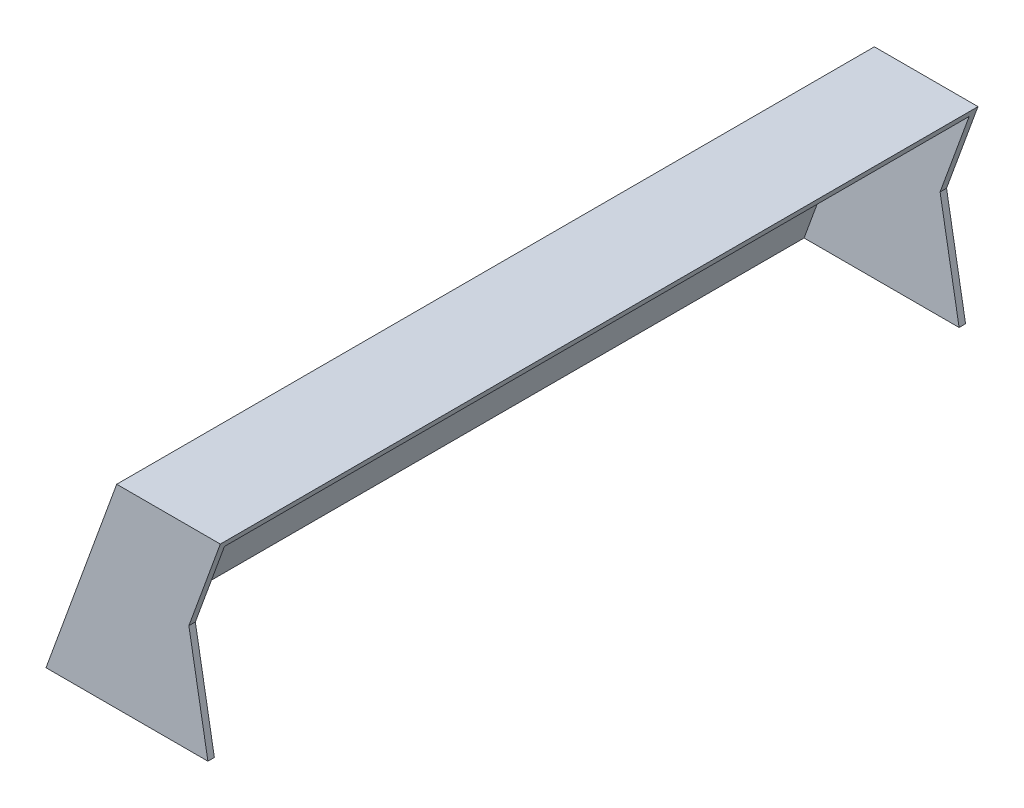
ISO-10303-21;
HEADER;
FILE_DESCRIPTION(('STEP AP214'),'2;1');
FILE_NAME('part.step','',(''),(''),'','','');
FILE_SCHEMA(('AUTOMOTIVE_DESIGN { 1 0 10303 214 1 1 1 1 }'));
ENDSEC;
DATA;
#1=APPLICATION_CONTEXT('core data for automotive mechanical design processes');
#2=APPLICATION_PROTOCOL_DEFINITION('international standard','automotive_design',2000,#1);
#3=PRODUCT_CONTEXT('',#1,'mechanical');
#4=PRODUCT('Part','Part','',(#3));
#5=PRODUCT_RELATED_PRODUCT_CATEGORY('part','',(#4));
#6=PRODUCT_DEFINITION_FORMATION('','',#4);
#7=PRODUCT_DEFINITION_CONTEXT('part definition',#1,'design');
#8=PRODUCT_DEFINITION('design','',#6,#7);
#9=PRODUCT_DEFINITION_SHAPE('','',#8);
#10=(LENGTH_UNIT() NAMED_UNIT(*) SI_UNIT(.MILLI.,.METRE.));
#11=(NAMED_UNIT(*) PLANE_ANGLE_UNIT() SI_UNIT($,.RADIAN.));
#12=(NAMED_UNIT(*) SI_UNIT($,.STERADIAN.) SOLID_ANGLE_UNIT());
#13=UNCERTAINTY_MEASURE_WITH_UNIT(LENGTH_MEASURE(1.E-05),#10,'distance_accuracy_value','');
#14=(GEOMETRIC_REPRESENTATION_CONTEXT(3) GLOBAL_UNCERTAINTY_ASSIGNED_CONTEXT((#13)) GLOBAL_UNIT_ASSIGNED_CONTEXT((#10,
#11,#12)) REPRESENTATION_CONTEXT('',''));
#15=CARTESIAN_POINT('',(0.,0.,0.));
#16=DIRECTION('',(0.,0.,1.));
#17=DIRECTION('',(1.,0.,0.));
#18=AXIS2_PLACEMENT_3D('',#15,#16,#17);
#19=CARTESIAN_POINT('',(0.,0.,1170.));
#20=DIRECTION('',(0.,1.,0.));
#21=DIRECTION('',(0.,0.,1.));
#22=AXIS2_PLACEMENT_3D('',#19,#20,#21);
#23=PLANE('',#22);
#24=DIRECTION('',(1.,0.,0.));
#25=VECTOR('',#24,1.);
#26=CARTESIAN_POINT('',(0.,0.,10.));
#27=LINE('',#26,#25);
#28=CARTESIAN_POINT('',(10.6417777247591,0.,10.));
#29=VERTEX_POINT('',#28);
#30=CARTESIAN_POINT('',(250.,0.,10.));
#31=VERTEX_POINT('',#30);
#32=EDGE_CURVE('E227',#29,#31,#27,.T.);
#33=ORIENTED_EDGE('',*,*,#32,.F.);
#34=DIRECTION('',(0.,0.,-1.));
#35=VECTOR('',#34,1.);
#36=CARTESIAN_POINT('',(10.6417777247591,0.,1170.));
#37=LINE('',#36,#35);
#38=CARTESIAN_POINT('',(10.6417777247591,0.,1160.));
#39=VERTEX_POINT('',#38);
#40=EDGE_CURVE('E242',#39,#29,#37,.T.);
#41=ORIENTED_EDGE('',*,*,#40,.F.);
#42=DIRECTION('',(1.,0.,0.));
#43=VECTOR('',#42,1.);
#44=CARTESIAN_POINT('',(0.,0.,1160.));
#45=LINE('',#44,#43);
#46=CARTESIAN_POINT('',(250.,0.,1160.));
#47=VERTEX_POINT('',#46);
#48=EDGE_CURVE('E231',#39,#47,#45,.T.);
#49=ORIENTED_EDGE('',*,*,#48,.T.);
#50=DIRECTION('',(0.,0.,-1.));
#51=VECTOR('',#50,1.);
#52=CARTESIAN_POINT('',(250.,0.,1170.));
#53=LINE('',#52,#51);
#54=CARTESIAN_POINT('',(250.,0.,1170.));
#55=VERTEX_POINT('',#54);
#56=EDGE_CURVE('E41',#55,#47,#53,.T.);
#57=ORIENTED_EDGE('',*,*,#56,.F.);
#58=DIRECTION('',(1.,0.,0.));
#59=VECTOR('',#58,1.);
#60=CARTESIAN_POINT('',(0.,0.,1170.));
#61=LINE('',#60,#59);
#62=CARTESIAN_POINT('',(0.,0.,1170.));
#63=VERTEX_POINT('',#62);
#64=EDGE_CURVE('E261',#63,#55,#61,.T.);
#65=ORIENTED_EDGE('',*,*,#64,.F.);
#66=DIRECTION('',(0.,0.,-1.));
#67=VECTOR('',#66,1.);
#68=CARTESIAN_POINT('',(0.,0.,1170.));
#69=LINE('',#68,#67);
#70=CARTESIAN_POINT('',(0.,0.,0.));
#71=VERTEX_POINT('',#70);
#72=EDGE_CURVE('E11',#63,#71,#69,.T.);
#73=ORIENTED_EDGE('',*,*,#72,.T.);
#74=DIRECTION('',(1.,0.,0.));
#75=VECTOR('',#74,1.);
#76=CARTESIAN_POINT('',(0.,0.,0.));
#77=LINE('',#76,#75);
#78=CARTESIAN_POINT('',(250.,0.,0.));
#79=VERTEX_POINT('',#78);
#80=EDGE_CURVE('E273',#71,#79,#77,.T.);
#81=ORIENTED_EDGE('',*,*,#80,.T.);
#82=EDGE_CURVE('E290',#31,#79,#53,.T.);
#83=ORIENTED_EDGE('',*,*,#82,.F.);
#84=EDGE_LOOP('',(#33,#41,#49,#57,#65,#73,#81,#83));
#85=FACE_BOUND('',#84,.T.);
#86=ADVANCED_FACE('F33',(#85),#23,.F.);
#87=CARTESIAN_POINT('',(220.628335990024,166.5749841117,1170.));
#88=DIRECTION('',(-0.984807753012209,-0.173648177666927,0.));
#89=DIRECTION('',(0.173648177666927,-0.984807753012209,0.));
#90=AXIS2_PLACEMENT_3D('',#87,#88,#89);
#91=PLANE('',#90);
#92=DIRECTION('',(-0.173648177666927,0.984807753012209,0.));
#93=VECTOR('',#92,1.);
#94=CARTESIAN_POINT('',(242.461577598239,42.7525179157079,10.));
#95=LINE('',#94,#93);
#96=CARTESIAN_POINT('',(220.628335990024,166.5749841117,10.));
#97=VERTEX_POINT('',#96);
#98=EDGE_CURVE('E246',#31,#97,#95,.T.);
#99=ORIENTED_EDGE('',*,*,#98,.F.);
#100=ORIENTED_EDGE('',*,*,#82,.T.);
#101=DIRECTION('',(-0.173648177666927,0.984807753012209,0.));
#102=VECTOR('',#101,1.);
#103=CARTESIAN_POINT('',(220.628335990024,166.5749841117,0.));
#104=LINE('',#103,#102);
#105=CARTESIAN_POINT('',(220.628335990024,166.5749841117,0.));
#106=VERTEX_POINT('',#105);
#107=EDGE_CURVE('E276',#79,#106,#104,.T.);
#108=ORIENTED_EDGE('',*,*,#107,.T.);
#109=DIRECTION('',(0.,0.,-1.));
#110=VECTOR('',#109,1.);
#111=CARTESIAN_POINT('',(220.628335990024,166.5749841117,1170.));
#112=LINE('',#111,#110);
#113=EDGE_CURVE('E287',#97,#106,#112,.T.);
#114=ORIENTED_EDGE('',*,*,#113,.F.);
#115=EDGE_LOOP('',(#99,#100,#108,#114));
#116=FACE_BOUND('',#115,.T.);
#117=ADVANCED_FACE('F298',(#116),#91,.F.);
#118=CARTESIAN_POINT('',(269.19107027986,300.,1170.));
#119=DIRECTION('',(-0.93969262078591,0.342020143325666,0.));
#120=DIRECTION('',(-0.342020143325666,-0.93969262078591,0.));
#121=AXIS2_PLACEMENT_3D('',#118,#119,#120);
#122=PLANE('',#121);
#123=DIRECTION('',(0.342020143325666,0.93969262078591,0.));
#124=VECTOR('',#123,1.);
#125=CARTESIAN_POINT('',(141.283555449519,-51.4230087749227,10.));
#126=LINE('',#125,#124);
#127=CARTESIAN_POINT('',(265.551367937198,290.,10.));
#128=VERTEX_POINT('',#127);
#129=EDGE_CURVE('E239',#97,#128,#126,.T.);
#130=ORIENTED_EDGE('',*,*,#129,.F.);
#131=ORIENTED_EDGE('',*,*,#113,.T.);
#132=DIRECTION('',(0.342020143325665,0.939692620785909,0.));
#133=VECTOR('',#132,1.);
#134=CARTESIAN_POINT('',(269.19107027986,300.,0.));
#135=LINE('',#134,#133);
#136=CARTESIAN_POINT('',(269.19107027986,300.,0.));
#137=VERTEX_POINT('',#136);
#138=EDGE_CURVE('E279',#106,#137,#135,.T.);
#139=ORIENTED_EDGE('',*,*,#138,.T.);
#140=DIRECTION('',(0.,0.,-1.));
#141=VECTOR('',#140,1.);
#142=CARTESIAN_POINT('',(269.19107027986,300.,1170.));
#143=LINE('',#142,#141);
#144=CARTESIAN_POINT('',(269.19107027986,300.,1170.));
#145=VERTEX_POINT('',#144);
#146=EDGE_CURVE('E284',#145,#137,#143,.T.);
#147=ORIENTED_EDGE('',*,*,#146,.F.);
#148=DIRECTION('',(0.342020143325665,0.939692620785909,0.));
#149=VECTOR('',#148,1.);
#150=CARTESIAN_POINT('',(269.19107027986,300.,1170.));
#151=LINE('',#150,#149);
#152=CARTESIAN_POINT('',(220.628335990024,166.5749841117,1170.));
#153=VERTEX_POINT('',#152);
#154=EDGE_CURVE('E266',#153,#145,#151,.T.);
#155=ORIENTED_EDGE('',*,*,#154,.F.);
#156=CARTESIAN_POINT('',(220.628335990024,166.5749841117,1160.));
#157=VERTEX_POINT('',#156);
#158=EDGE_CURVE('E288',#153,#157,#112,.T.);
#159=ORIENTED_EDGE('',*,*,#158,.T.);
#160=DIRECTION('',(0.342020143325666,0.93969262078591,0.));
#161=VECTOR('',#160,1.);
#162=CARTESIAN_POINT('',(141.283555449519,-51.4230087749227,1160.));
#163=LINE('',#162,#161);
#164=CARTESIAN_POINT('',(265.551367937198,290.,1160.));
#165=VERTEX_POINT('',#164);
#166=EDGE_CURVE('E241',#157,#165,#163,.T.);
#167=ORIENTED_EDGE('',*,*,#166,.T.);
#168=DIRECTION('',(0.,0.,-1.));
#169=VECTOR('',#168,1.);
#170=CARTESIAN_POINT('',(265.551367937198,290.,1170.));
#171=LINE('',#170,#169);
#172=EDGE_CURVE('E236',#165,#128,#171,.T.);
#173=ORIENTED_EDGE('',*,*,#172,.T.);
#174=EDGE_LOOP('',(#130,#131,#139,#147,#155,#159,#167,#173));
#175=FACE_BOUND('',#174,.T.);
#176=ADVANCED_FACE('F312',(#175),#122,.F.);
#177=CARTESIAN_POINT('',(0.,0.,1170.));
#178=DIRECTION('',(0.93969262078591,-0.342020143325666,0.));
#179=DIRECTION('',(0.342020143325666,0.93969262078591,0.));
#180=AXIS2_PLACEMENT_3D('',#177,#178,#179);
#181=PLANE('',#180);
#182=DIRECTION('',(-0.342020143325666,-0.93969262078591,0.));
#183=VECTOR('',#182,1.);
#184=CARTESIAN_POINT('',(74.9890559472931,206.030737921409,60.0000000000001));
#185=LINE('',#184,#183);
#186=CARTESIAN_POINT('',(74.9890559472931,206.030737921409,60.0000000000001));
#187=VERTEX_POINT('',#186);
#188=CARTESIAN_POINT('',(49.3375451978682,135.553791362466,60.0000000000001));
#189=VERTEX_POINT('',#188);
#190=EDGE_CURVE('E177',#187,#189,#185,.T.);
#191=ORIENTED_EDGE('',*,*,#190,.F.);
#192=CARTESIAN_POINT('',(74.9890559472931,206.030737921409,120.));
#193=DIRECTION('',(-0.93969262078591,0.342020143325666,0.));
#194=DIRECTION('',(0.342020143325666,0.93969262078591,0.));
#195=AXIS2_PLACEMENT_3D('',#192,#193,#194);
#196=CIRCLE('',#195,60.0000000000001);
#197=CARTESIAN_POINT('',(74.9890559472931,206.030737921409,180.));
#198=VERTEX_POINT('',#197);
#199=EDGE_CURVE('E48',#198,#187,#196,.T.);
#200=ORIENTED_EDGE('',*,*,#199,.F.);
#201=DIRECTION('',(0.342020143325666,0.93969262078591,0.));
#202=VECTOR('',#201,1.);
#203=CARTESIAN_POINT('',(74.9890559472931,206.030737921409,180.));
#204=LINE('',#203,#202);
#205=CARTESIAN_POINT('',(49.3375451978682,135.553791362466,180.));
#206=VERTEX_POINT('',#205);
#207=EDGE_CURVE('E170',#206,#198,#204,.T.);
#208=ORIENTED_EDGE('',*,*,#207,.F.);
#209=CARTESIAN_POINT('',(49.3375451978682,135.553791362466,120.));
#210=DIRECTION('',(-0.93969262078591,0.342020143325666,0.));
#211=DIRECTION('',(0.342020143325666,0.93969262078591,0.));
#212=AXIS2_PLACEMENT_3D('',#209,#210,#211);
#213=CIRCLE('',#212,60.0000000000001);
#214=EDGE_CURVE('E184',#189,#206,#213,.T.);
#215=ORIENTED_EDGE('',*,*,#214,.F.);
#216=EDGE_LOOP('',(#191,#200,#208,#215));
#217=FACE_BOUND('',#216,.T.);
#218=DIRECTION('',(-0.342020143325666,-0.93969262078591,0.));
#219=VECTOR('',#218,1.);
#220=CARTESIAN_POINT('',(74.9890559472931,206.030737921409,990.));
#221=LINE('',#220,#219);
#222=CARTESIAN_POINT('',(74.9890559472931,206.030737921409,990.));
#223=VERTEX_POINT('',#222);
#224=CARTESIAN_POINT('',(49.3375451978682,135.553791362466,990.));
#225=VERTEX_POINT('',#224);
#226=EDGE_CURVE('E203',#223,#225,#221,.T.);
#227=ORIENTED_EDGE('',*,*,#226,.F.);
#228=CARTESIAN_POINT('',(74.9890559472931,206.030737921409,1050.));
#229=DIRECTION('',(-0.93969262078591,0.342020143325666,0.));
#230=DIRECTION('',(-0.342020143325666,-0.93969262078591,0.));
#231=AXIS2_PLACEMENT_3D('',#228,#229,#230);
#232=CIRCLE('',#231,60.0000000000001);
#233=CARTESIAN_POINT('',(74.9890559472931,206.030737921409,1110.));
#234=VERTEX_POINT('',#233);
#235=EDGE_CURVE('E201',#234,#223,#232,.T.);
#236=ORIENTED_EDGE('',*,*,#235,.F.);
#237=DIRECTION('',(0.342020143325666,0.93969262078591,0.));
#238=VECTOR('',#237,1.);
#239=CARTESIAN_POINT('',(74.9890559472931,206.030737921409,1110.));
#240=LINE('',#239,#238);
#241=CARTESIAN_POINT('',(49.3375451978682,135.553791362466,1110.));
#242=VERTEX_POINT('',#241);
#243=EDGE_CURVE('E209',#242,#234,#240,.T.);
#244=ORIENTED_EDGE('',*,*,#243,.F.);
#245=CARTESIAN_POINT('',(49.3375451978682,135.553791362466,1050.));
#246=DIRECTION('',(-0.93969262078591,0.342020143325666,0.));
#247=DIRECTION('',(-0.342020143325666,-0.93969262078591,0.));
#248=AXIS2_PLACEMENT_3D('',#245,#246,#247);
#249=CIRCLE('',#248,60.0000000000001);
#250=EDGE_CURVE('E206',#225,#242,#249,.T.);
#251=ORIENTED_EDGE('',*,*,#250,.F.);
#252=EDGE_LOOP('',(#227,#236,#244,#251));
#253=FACE_BOUND('',#252,.T.);
#254=DIRECTION('',(-0.342020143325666,-0.939692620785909,0.));
#255=VECTOR('',#254,1.);
#256=CARTESIAN_POINT('',(0.,0.,0.));
#257=LINE('',#256,#255);
#258=CARTESIAN_POINT('',(109.19107027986,300.,0.));
#259=VERTEX_POINT('',#258);
#260=EDGE_CURVE('E244',#259,#71,#257,.T.);
#261=ORIENTED_EDGE('',*,*,#260,.T.);
#262=ORIENTED_EDGE('',*,*,#72,.F.);
#263=DIRECTION('',(-0.342020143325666,-0.939692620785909,0.));
#264=VECTOR('',#263,1.);
#265=CARTESIAN_POINT('',(0.,0.,1170.));
#266=LINE('',#265,#264);
#267=CARTESIAN_POINT('',(109.19107027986,300.,1170.));
#268=VERTEX_POINT('',#267);
#269=EDGE_CURVE('E258',#268,#63,#266,.T.);
#270=ORIENTED_EDGE('',*,*,#269,.F.);
#271=DIRECTION('',(0.,0.,-1.));
#272=VECTOR('',#271,1.);
#273=CARTESIAN_POINT('',(109.19107027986,300.,1170.));
#274=LINE('',#273,#272);
#275=EDGE_CURVE('E270',#268,#259,#274,.T.);
#276=ORIENTED_EDGE('',*,*,#275,.T.);
#277=EDGE_LOOP('',(#261,#262,#270,#276));
#278=FACE_BOUND('',#277,.T.);
#279=ADVANCED_FACE('F35',(#217,#253,#278),#181,.F.);
#280=ORIENTED_EDGE('',*,*,#56,.T.);
#281=DIRECTION('',(-0.173648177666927,0.984807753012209,0.));
#282=VECTOR('',#281,1.);
#283=CARTESIAN_POINT('',(242.461577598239,42.7525179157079,1160.));
#284=LINE('',#283,#282);
#285=EDGE_CURVE('E253',#47,#157,#284,.T.);
#286=ORIENTED_EDGE('',*,*,#285,.T.);
#287=ORIENTED_EDGE('',*,*,#158,.F.);
#288=DIRECTION('',(-0.173648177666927,0.984807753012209,0.));
#289=VECTOR('',#288,1.);
#290=CARTESIAN_POINT('',(220.628335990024,166.5749841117,1170.));
#291=LINE('',#290,#289);
#292=EDGE_CURVE('E264',#55,#153,#291,.T.);
#293=ORIENTED_EDGE('',*,*,#292,.F.);
#294=EDGE_LOOP('',(#280,#286,#287,#293));
#295=FACE_BOUND('',#294,.T.);
#296=ADVANCED_FACE('F322',(#295),#91,.F.);
#297=CARTESIAN_POINT('',(109.19107027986,300.,1170.));
#298=DIRECTION('',(0.,-1.,0.));
#299=DIRECTION('',(1.,0.,0.));
#300=AXIS2_PLACEMENT_3D('',#297,#298,#299);
#301=PLANE('',#300);
#302=DIRECTION('',(-1.,0.,0.));
#303=VECTOR('',#302,1.);
#304=CARTESIAN_POINT('',(109.19107027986,300.,0.));
#305=LINE('',#304,#303);
#306=EDGE_CURVE('E262',#137,#259,#305,.T.);
#307=ORIENTED_EDGE('',*,*,#306,.T.);
#308=ORIENTED_EDGE('',*,*,#275,.F.);
#309=DIRECTION('',(-1.,0.,0.));
#310=VECTOR('',#309,1.);
#311=CARTESIAN_POINT('',(109.19107027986,300.,1170.));
#312=LINE('',#311,#310);
#313=EDGE_CURVE('E268',#145,#268,#312,.T.);
#314=ORIENTED_EDGE('',*,*,#313,.F.);
#315=ORIENTED_EDGE('',*,*,#146,.T.);
#316=EDGE_LOOP('',(#307,#308,#314,#315));
#317=FACE_BOUND('',#316,.T.);
#318=ADVANCED_FACE('F316',(#317),#301,.F.);
#319=CARTESIAN_POINT('',(0.,0.,1170.));
#320=DIRECTION('',(0.,0.,-1.));
#321=DIRECTION('',(-1.,0.,0.));
#322=AXIS2_PLACEMENT_3D('',#319,#320,#321);
#323=PLANE('',#322);
#324=ORIENTED_EDGE('',*,*,#269,.T.);
#325=ORIENTED_EDGE('',*,*,#64,.T.);
#326=ORIENTED_EDGE('',*,*,#292,.T.);
#327=ORIENTED_EDGE('',*,*,#154,.T.);
#328=ORIENTED_EDGE('',*,*,#313,.T.);
#329=EDGE_LOOP('',(#324,#325,#326,#327,#328));
#330=FACE_BOUND('',#329,.T.);
#331=ADVANCED_FACE('F320',(#330),#323,.F.);
#332=CARTESIAN_POINT('',(0.,0.,0.));
#333=DIRECTION('',(0.,0.,-1.));
#334=DIRECTION('',(-1.,0.,0.));
#335=AXIS2_PLACEMENT_3D('',#332,#333,#334);
#336=PLANE('',#335);
#337=ORIENTED_EDGE('',*,*,#260,.F.);
#338=ORIENTED_EDGE('',*,*,#306,.F.);
#339=ORIENTED_EDGE('',*,*,#138,.F.);
#340=ORIENTED_EDGE('',*,*,#107,.F.);
#341=ORIENTED_EDGE('',*,*,#80,.F.);
#342=EDGE_LOOP('',(#337,#338,#339,#340,#341));
#343=FACE_BOUND('',#342,.T.);
#344=ADVANCED_FACE('F307',(#343),#336,.T.);
#345=CARTESIAN_POINT('',(9.3969262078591,-3.42020143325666,1170.));
#346=DIRECTION('',(0.93969262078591,-0.342020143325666,0.));
#347=DIRECTION('',(0.342020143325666,0.93969262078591,0.));
#348=AXIS2_PLACEMENT_3D('',#345,#346,#347);
#349=PLANE('',#348);
#350=CARTESIAN_POINT('',(84.3859821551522,202.610536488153,120.));
#351=DIRECTION('',(0.93969262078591,-0.342020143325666,0.));
#352=DIRECTION('',(0.342020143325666,0.93969262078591,0.));
#353=AXIS2_PLACEMENT_3D('',#350,#351,#352);
#354=CIRCLE('',#353,60.0000000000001);
#355=CARTESIAN_POINT('',(84.3859821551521,202.610536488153,180.));
#356=VERTEX_POINT('',#355);
#357=CARTESIAN_POINT('',(84.3859821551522,202.610536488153,60.0000000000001));
#358=VERTEX_POINT('',#357);
#359=EDGE_CURVE('E168',#356,#358,#354,.F.);
#360=ORIENTED_EDGE('',*,*,#359,.T.);
#361=DIRECTION('',(-0.342020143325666,-0.93969262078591,0.));
#362=VECTOR('',#361,1.);
#363=CARTESIAN_POINT('',(84.3859821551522,202.610536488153,60.0000000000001));
#364=LINE('',#363,#362);
#365=CARTESIAN_POINT('',(58.7344714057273,132.133589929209,60.0000000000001));
#366=VERTEX_POINT('',#365);
#367=EDGE_CURVE('E157',#358,#366,#364,.T.);
#368=ORIENTED_EDGE('',*,*,#367,.T.);
#369=CARTESIAN_POINT('',(58.7344714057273,132.133589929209,120.));
#370=DIRECTION('',(0.93969262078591,-0.342020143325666,0.));
#371=DIRECTION('',(0.342020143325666,0.93969262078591,0.));
#372=AXIS2_PLACEMENT_3D('',#369,#370,#371);
#373=CIRCLE('',#372,60.0000000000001);
#374=CARTESIAN_POINT('',(58.7344714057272,132.133589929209,180.));
#375=VERTEX_POINT('',#374);
#376=EDGE_CURVE('E179',#366,#375,#373,.F.);
#377=ORIENTED_EDGE('',*,*,#376,.T.);
#378=DIRECTION('',(0.342020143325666,0.93969262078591,0.));
#379=VECTOR('',#378,1.);
#380=CARTESIAN_POINT('',(84.3859821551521,202.610536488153,180.));
#381=LINE('',#380,#379);
#382=EDGE_CURVE('E175',#375,#356,#381,.T.);
#383=ORIENTED_EDGE('',*,*,#382,.T.);
#384=EDGE_LOOP('',(#360,#368,#377,#383));
#385=FACE_BOUND('',#384,.T.);
#386=CARTESIAN_POINT('',(84.3859821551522,202.610536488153,1050.));
#387=DIRECTION('',(0.93969262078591,-0.342020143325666,0.));
#388=DIRECTION('',(0.342020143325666,0.93969262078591,0.));
#389=AXIS2_PLACEMENT_3D('',#386,#387,#388);
#390=CIRCLE('',#389,60.0000000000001);
#391=CARTESIAN_POINT('',(84.3859821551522,202.610536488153,1110.));
#392=VERTEX_POINT('',#391);
#393=CARTESIAN_POINT('',(84.3859821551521,202.610536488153,990.));
#394=VERTEX_POINT('',#393);
#395=EDGE_CURVE('E198',#392,#394,#390,.F.);
#396=ORIENTED_EDGE('',*,*,#395,.T.);
#397=DIRECTION('',(-0.342020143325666,-0.93969262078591,0.));
#398=VECTOR('',#397,1.);
#399=CARTESIAN_POINT('',(84.3859821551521,202.610536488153,990.));
#400=LINE('',#399,#398);
#401=CARTESIAN_POINT('',(58.7344714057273,132.133589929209,990.));
#402=VERTEX_POINT('',#401);
#403=EDGE_CURVE('E215',#394,#402,#400,.T.);
#404=ORIENTED_EDGE('',*,*,#403,.T.);
#405=CARTESIAN_POINT('',(58.7344714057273,132.133589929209,1050.));
#406=DIRECTION('',(0.93969262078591,-0.342020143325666,0.));
#407=DIRECTION('',(0.342020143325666,0.93969262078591,0.));
#408=AXIS2_PLACEMENT_3D('',#405,#406,#407);
#409=CIRCLE('',#408,60.0000000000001);
#410=CARTESIAN_POINT('',(58.7344714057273,132.133589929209,1110.));
#411=VERTEX_POINT('',#410);
#412=EDGE_CURVE('E164',#402,#411,#409,.F.);
#413=ORIENTED_EDGE('',*,*,#412,.T.);
#414=DIRECTION('',(0.342020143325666,0.93969262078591,0.));
#415=VECTOR('',#414,1.);
#416=CARTESIAN_POINT('',(84.3859821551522,202.610536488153,1110.));
#417=LINE('',#416,#415);
#418=EDGE_CURVE('E195',#411,#392,#417,.T.);
#419=ORIENTED_EDGE('',*,*,#418,.T.);
#420=EDGE_LOOP('',(#396,#404,#413,#419));
#421=FACE_BOUND('',#420,.T.);
#422=DIRECTION('',(-0.342020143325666,-0.93969262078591,0.));
#423=VECTOR('',#422,1.);
#424=CARTESIAN_POINT('',(9.3969262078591,-3.42020143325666,10.));
#425=LINE('',#424,#423);
#426=CARTESIAN_POINT('',(116.193145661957,290.,10.));
#427=VERTEX_POINT('',#426);
#428=EDGE_CURVE('E224',#427,#29,#425,.T.);
#429=ORIENTED_EDGE('',*,*,#428,.F.);
#430=DIRECTION('',(0.,0.,-1.));
#431=VECTOR('',#430,1.);
#432=CARTESIAN_POINT('',(116.193145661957,290.,1170.));
#433=LINE('',#432,#431);
#434=CARTESIAN_POINT('',(116.193145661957,290.,1160.));
#435=VERTEX_POINT('',#434);
#436=EDGE_CURVE('E233',#435,#427,#433,.T.);
#437=ORIENTED_EDGE('',*,*,#436,.F.);
#438=DIRECTION('',(-0.342020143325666,-0.93969262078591,0.));
#439=VECTOR('',#438,1.);
#440=CARTESIAN_POINT('',(9.3969262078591,-3.42020143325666,1160.));
#441=LINE('',#440,#439);
#442=EDGE_CURVE('E228',#435,#39,#441,.T.);
#443=ORIENTED_EDGE('',*,*,#442,.T.);
#444=ORIENTED_EDGE('',*,*,#40,.T.);
#445=EDGE_LOOP('',(#429,#437,#443,#444));
#446=FACE_BOUND('',#445,.T.);
#447=ADVANCED_FACE('F173',(#385,#421,#446),#349,.T.);
#448=CARTESIAN_POINT('',(109.19107027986,290.,1170.));
#449=DIRECTION('',(0.,-1.,0.));
#450=DIRECTION('',(1.,0.,0.));
#451=AXIS2_PLACEMENT_3D('',#448,#449,#450);
#452=PLANE('',#451);
#453=DIRECTION('',(-1.,0.,0.));
#454=VECTOR('',#453,1.);
#455=CARTESIAN_POINT('',(-1.00613961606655E-13,290.,10.));
#456=LINE('',#455,#454);
#457=EDGE_CURVE('E232',#128,#427,#456,.T.);
#458=ORIENTED_EDGE('',*,*,#457,.F.);
#459=ORIENTED_EDGE('',*,*,#172,.F.);
#460=DIRECTION('',(-1.,0.,0.));
#461=VECTOR('',#460,1.);
#462=CARTESIAN_POINT('',(-1.00613961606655E-13,290.,1160.));
#463=LINE('',#462,#461);
#464=EDGE_CURVE('E237',#165,#435,#463,.T.);
#465=ORIENTED_EDGE('',*,*,#464,.T.);
#466=ORIENTED_EDGE('',*,*,#436,.T.);
#467=EDGE_LOOP('',(#458,#459,#465,#466));
#468=FACE_BOUND('',#467,.T.);
#469=ADVANCED_FACE('F335',(#468),#452,.T.);
#470=CARTESIAN_POINT('',(0.,0.,1160.));
#471=DIRECTION('',(0.,0.,-1.));
#472=DIRECTION('',(-1.,0.,0.));
#473=AXIS2_PLACEMENT_3D('',#470,#471,#472);
#474=PLANE('',#473);
#475=ORIENTED_EDGE('',*,*,#442,.F.);
#476=ORIENTED_EDGE('',*,*,#464,.F.);
#477=ORIENTED_EDGE('',*,*,#166,.F.);
#478=ORIENTED_EDGE('',*,*,#285,.F.);
#479=ORIENTED_EDGE('',*,*,#48,.F.);
#480=EDGE_LOOP('',(#475,#476,#477,#478,#479));
#481=FACE_BOUND('',#480,.T.);
#482=ADVANCED_FACE('F325',(#481),#474,.T.);
#483=CARTESIAN_POINT('',(0.,0.,10.));
#484=DIRECTION('',(0.,0.,-1.));
#485=DIRECTION('',(-1.,0.,0.));
#486=AXIS2_PLACEMENT_3D('',#483,#484,#485);
#487=PLANE('',#486);
#488=ORIENTED_EDGE('',*,*,#428,.T.);
#489=ORIENTED_EDGE('',*,*,#32,.T.);
#490=ORIENTED_EDGE('',*,*,#98,.T.);
#491=ORIENTED_EDGE('',*,*,#129,.T.);
#492=ORIENTED_EDGE('',*,*,#457,.T.);
#493=EDGE_LOOP('',(#488,#489,#490,#491,#492));
#494=FACE_BOUND('',#493,.T.);
#495=ADVANCED_FACE('F331',(#494),#487,.F.);
#496=CARTESIAN_POINT('',(312.691957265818,119.513957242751,1050.));
#497=DIRECTION('',(-0.939692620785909,0.342020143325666,0.));
#498=DIRECTION('',(-0.342020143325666,-0.93969262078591,0.));
#499=AXIS2_PLACEMENT_3D('',#496,#497,#498);
#500=CYLINDRICAL_SURFACE('',#499,60.0000000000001);
#501=DIRECTION('',(-0.939692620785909,0.342020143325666,0.));
#502=VECTOR('',#501,1.);
#503=CARTESIAN_POINT('',(312.691957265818,119.513957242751,1110.));
#504=LINE('',#503,#502);
#505=EDGE_CURVE('E213',#392,#234,#504,.T.);
#506=ORIENTED_EDGE('',*,*,#505,.T.);
#507=ORIENTED_EDGE('',*,*,#235,.T.);
#508=DIRECTION('',(-0.939692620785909,0.342020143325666,0.));
#509=VECTOR('',#508,1.);
#510=CARTESIAN_POINT('',(312.691957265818,119.513957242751,990.));
#511=LINE('',#510,#509);
#512=EDGE_CURVE('E212',#394,#223,#511,.T.);
#513=ORIENTED_EDGE('',*,*,#512,.F.);
#514=ORIENTED_EDGE('',*,*,#395,.F.);
#515=EDGE_LOOP('',(#506,#507,#513,#514));
#516=FACE_BOUND('',#515,.T.);
#517=ADVANCED_FACE('F360',(#516),#500,.F.);
#518=CARTESIAN_POINT('',(312.691957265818,119.513957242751,1110.));
#519=DIRECTION('',(0.,0.,1.));
#520=DIRECTION('',(1.,0.,0.));
#521=AXIS2_PLACEMENT_3D('',#518,#519,#520);
#522=PLANE('',#521);
#523=DIRECTION('',(-0.939692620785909,0.342020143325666,0.));
#524=VECTOR('',#523,1.);
#525=CARTESIAN_POINT('',(287.040446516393,49.0370106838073,1110.));
#526=LINE('',#525,#524);
#527=EDGE_CURVE('E216',#411,#242,#526,.T.);
#528=ORIENTED_EDGE('',*,*,#527,.T.);
#529=ORIENTED_EDGE('',*,*,#243,.T.);
#530=ORIENTED_EDGE('',*,*,#505,.F.);
#531=ORIENTED_EDGE('',*,*,#418,.F.);
#532=EDGE_LOOP('',(#528,#529,#530,#531));
#533=FACE_BOUND('',#532,.T.);
#534=ADVANCED_FACE('F364',(#533),#522,.F.);
#535=CARTESIAN_POINT('',(287.040446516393,49.0370106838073,1050.));
#536=DIRECTION('',(-0.939692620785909,0.342020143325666,0.));
#537=DIRECTION('',(-0.342020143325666,-0.93969262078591,0.));
#538=AXIS2_PLACEMENT_3D('',#535,#536,#537);
#539=CYLINDRICAL_SURFACE('',#538,60.0000000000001);
#540=DIRECTION('',(-0.939692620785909,0.342020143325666,0.));
#541=VECTOR('',#540,1.);
#542=CARTESIAN_POINT('',(287.040446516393,49.0370106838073,990.));
#543=LINE('',#542,#541);
#544=EDGE_CURVE('E218',#402,#225,#543,.T.);
#545=ORIENTED_EDGE('',*,*,#544,.T.);
#546=ORIENTED_EDGE('',*,*,#250,.T.);
#547=ORIENTED_EDGE('',*,*,#527,.F.);
#548=ORIENTED_EDGE('',*,*,#412,.F.);
#549=EDGE_LOOP('',(#545,#546,#547,#548));
#550=FACE_BOUND('',#549,.T.);
#551=ADVANCED_FACE('F370',(#550),#539,.F.);
#552=CARTESIAN_POINT('',(312.691957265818,119.513957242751,990.));
#553=DIRECTION('',(0.,0.,-1.));
#554=DIRECTION('',(-1.,0.,0.));
#555=AXIS2_PLACEMENT_3D('',#552,#553,#554);
#556=PLANE('',#555);
#557=ORIENTED_EDGE('',*,*,#512,.T.);
#558=ORIENTED_EDGE('',*,*,#226,.T.);
#559=ORIENTED_EDGE('',*,*,#544,.F.);
#560=ORIENTED_EDGE('',*,*,#403,.F.);
#561=EDGE_LOOP('',(#557,#558,#559,#560));
#562=FACE_BOUND('',#561,.T.);
#563=ADVANCED_FACE('F374',(#562),#556,.F.);
#564=CARTESIAN_POINT('',(312.691957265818,119.513957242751,120.));
#565=DIRECTION('',(-0.939692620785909,0.342020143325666,0.));
#566=DIRECTION('',(-0.342020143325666,-0.93969262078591,0.));
#567=AXIS2_PLACEMENT_3D('',#564,#565,#566);
#568=CYLINDRICAL_SURFACE('',#567,60.0000000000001);
#569=DIRECTION('',(-0.939692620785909,0.342020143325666,0.));
#570=VECTOR('',#569,1.);
#571=CARTESIAN_POINT('',(312.691957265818,119.513957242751,180.));
#572=LINE('',#571,#570);
#573=EDGE_CURVE('E165',#356,#198,#572,.T.);
#574=ORIENTED_EDGE('',*,*,#573,.T.);
#575=ORIENTED_EDGE('',*,*,#199,.T.);
#576=DIRECTION('',(-0.939692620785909,0.342020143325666,0.));
#577=VECTOR('',#576,1.);
#578=CARTESIAN_POINT('',(312.691957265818,119.513957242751,60.0000000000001));
#579=LINE('',#578,#577);
#580=EDGE_CURVE('E159',#358,#187,#579,.T.);
#581=ORIENTED_EDGE('',*,*,#580,.F.);
#582=ORIENTED_EDGE('',*,*,#359,.F.);
#583=EDGE_LOOP('',(#574,#575,#581,#582));
#584=FACE_BOUND('',#583,.T.);
#585=ADVANCED_FACE('F167',(#584),#568,.F.);
#586=CARTESIAN_POINT('',(312.691957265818,119.513957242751,180.));
#587=DIRECTION('',(0.,0.,1.));
#588=DIRECTION('',(1.,0.,0.));
#589=AXIS2_PLACEMENT_3D('',#586,#587,#588);
#590=PLANE('',#589);
#591=DIRECTION('',(-0.939692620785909,0.342020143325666,0.));
#592=VECTOR('',#591,1.);
#593=CARTESIAN_POINT('',(287.040446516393,49.0370106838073,180.));
#594=LINE('',#593,#592);
#595=EDGE_CURVE('E190',#375,#206,#594,.T.);
#596=ORIENTED_EDGE('',*,*,#595,.T.);
#597=ORIENTED_EDGE('',*,*,#207,.T.);
#598=ORIENTED_EDGE('',*,*,#573,.F.);
#599=ORIENTED_EDGE('',*,*,#382,.F.);
#600=EDGE_LOOP('',(#596,#597,#598,#599));
#601=FACE_BOUND('',#600,.T.);
#602=ADVANCED_FACE('F383',(#601),#590,.F.);
#603=CARTESIAN_POINT('',(287.040446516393,49.0370106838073,120.));
#604=DIRECTION('',(-0.939692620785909,0.342020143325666,0.));
#605=DIRECTION('',(-0.342020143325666,-0.93969262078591,0.));
#606=AXIS2_PLACEMENT_3D('',#603,#604,#605);
#607=CYLINDRICAL_SURFACE('',#606,60.0000000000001);
#608=DIRECTION('',(-0.939692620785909,0.342020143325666,0.));
#609=VECTOR('',#608,1.);
#610=CARTESIAN_POINT('',(287.040446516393,49.0370106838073,60.0000000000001));
#611=LINE('',#610,#609);
#612=EDGE_CURVE('E56',#366,#189,#611,.T.);
#613=ORIENTED_EDGE('',*,*,#612,.T.);
#614=ORIENTED_EDGE('',*,*,#214,.T.);
#615=ORIENTED_EDGE('',*,*,#595,.F.);
#616=ORIENTED_EDGE('',*,*,#376,.F.);
#617=EDGE_LOOP('',(#613,#614,#615,#616));
#618=FACE_BOUND('',#617,.T.);
#619=ADVANCED_FACE('F386',(#618),#607,.F.);
#620=CARTESIAN_POINT('',(312.691957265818,119.513957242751,60.0000000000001));
#621=DIRECTION('',(0.,0.,-1.));
#622=DIRECTION('',(-1.,0.,0.));
#623=AXIS2_PLACEMENT_3D('',#620,#621,#622);
#624=PLANE('',#623);
#625=ORIENTED_EDGE('',*,*,#580,.T.);
#626=ORIENTED_EDGE('',*,*,#190,.T.);
#627=ORIENTED_EDGE('',*,*,#612,.F.);
#628=ORIENTED_EDGE('',*,*,#367,.F.);
#629=EDGE_LOOP('',(#625,#626,#627,#628));
#630=FACE_BOUND('',#629,.T.);
#631=ADVANCED_FACE('F158',(#630),#624,.F.);
#632=CLOSED_SHELL('',(#86,#117,#176,#279,#296,#318,#331,#344,#447,#469,#482,#495,#517,#534,#551,
#563,#585,#602,#619,#631));
#633=MANIFOLD_SOLID_BREP('B2',#632);
#634=ADVANCED_BREP_SHAPE_REPRESENTATION('',(#18,#633),#14);
#635=SHAPE_DEFINITION_REPRESENTATION(#9,#634);
ENDSEC;
END-ISO-10303-21;
